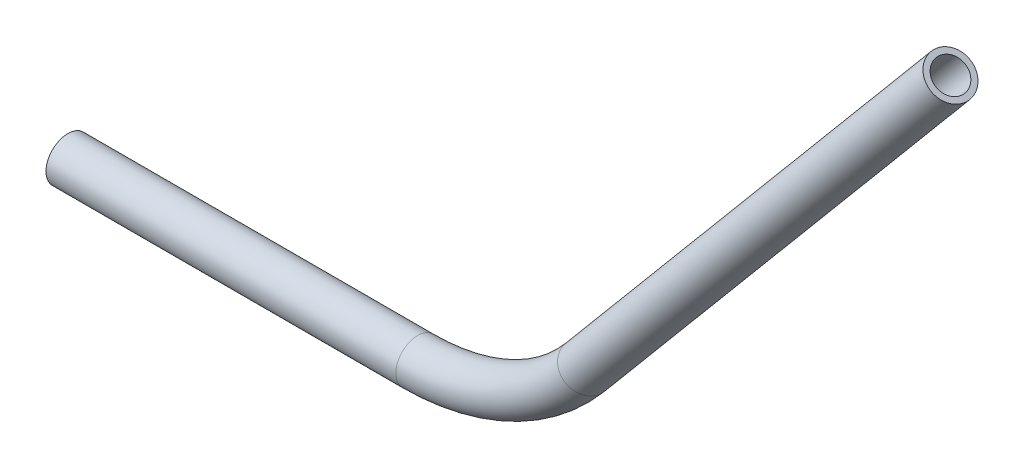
from build123d import *

# Parameters (mm, degrees)
SKETCH2_R   = 6.35
SKETCH2_R_2 = 4.699


with BuildPart() as part:
    # Sweep-Thin1: sweep along a path in Sketch3
    with BuildLine(Plane.XY) as sweep_thin1_path:
        Line((0, 0), (101.6, 0))
        ThreePointArc((101.6, 0), (128.436259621, 5.949455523), (150.243822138, 22.682986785))
        Line((150.243822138, 22.682986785), (256.368056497, 149.156924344))
    # Sketch2 → Sweep-Thin1 (sweep)
    with BuildSketch(Plane(origin=(0, 0, 0), x_dir=(0, 0, -1), z_dir=(1, 0, 0))):
        Circle(SKETCH2_R)
        Circle(SKETCH2_R_2, mode=Mode.SUBTRACT)
    sweep(path=sweep_thin1_path.line)


solid = part.part
